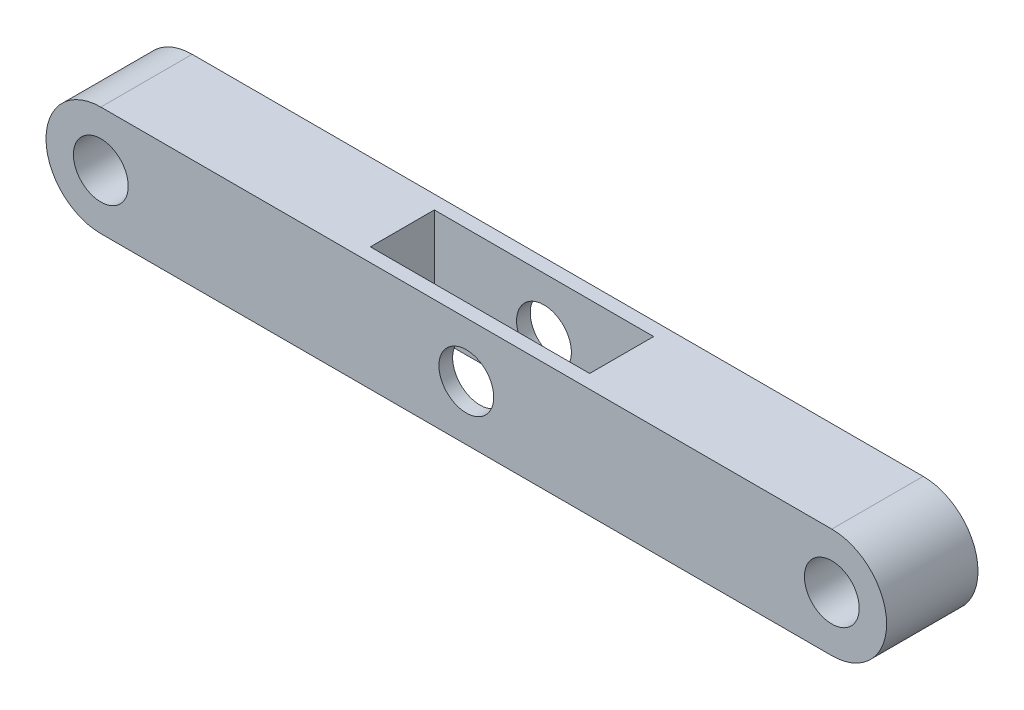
from build123d import *

# Parameters (mm, degrees)
SKETCH1_R          = 3
EXTRUDE1_DEPTH     = 5
CUT_EXTRUDE1_DEPTH = 3.5
SKETCH3_R          = 3
CUT_EXTRUDE2_DEPTH = 87.787095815


with BuildPart() as part:
    # Sketch1 → Extrude1 (new, symmetric)
    with BuildSketch(Plane.XY):
        with BuildLine():
            Line((0, -6), (80, -6))
            ThreePointArc((80, -6), (86, 0), (80, 6))
            Line((80, 6), (0, 6))
            ThreePointArc((0, 6), (-6, 0), (0, -6))
        make_face()
        Circle(SKETCH1_R, mode=Mode.SUBTRACT)
        with Locations((80, 0)):
            Circle(SKETCH1_R, mode=Mode.SUBTRACT)
    extrude(amount=EXTRUDE1_DEPTH, both=True)

    # Sketch2 → Cut-Extrude1 (cut, symmetric)
    with BuildSketch(Plane.XY):
        Polygon((40, 6), (52, 6), (52, -6), (28, -6), (28, 6), align=None)
    extrude(amount=CUT_EXTRUDE1_DEPTH, both=True, mode=Mode.SUBTRACT)

    # Sketch3 → Cut-Extrude2 (cut, through all)
    with BuildSketch(Plane.XY.offset(5)):
        with Locations((40, 0)):
            Circle(SKETCH3_R)
    extrude(amount=-CUT_EXTRUDE2_DEPTH, mode=Mode.SUBTRACT)


solid = part.part
